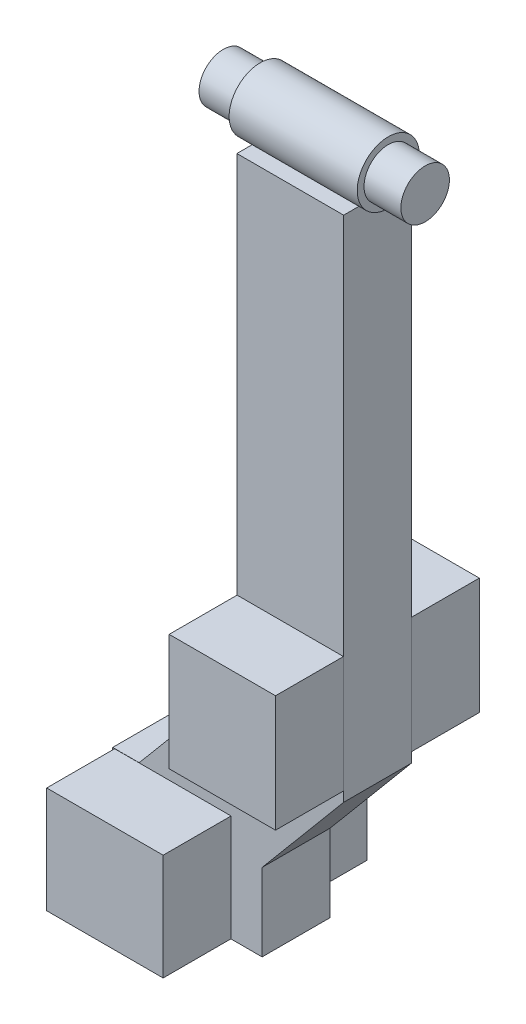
ISO-10303-21;
HEADER;
FILE_DESCRIPTION(('STEP AP214'),'2;1');
FILE_NAME('part.step','',(''),(''),'','','');
FILE_SCHEMA(('AUTOMOTIVE_DESIGN { 1 0 10303 214 1 1 1 1 }'));
ENDSEC;
DATA;
#1=APPLICATION_CONTEXT('core data for automotive mechanical design processes');
#2=APPLICATION_PROTOCOL_DEFINITION('international standard','automotive_design',2000,#1);
#3=PRODUCT_CONTEXT('',#1,'mechanical');
#4=PRODUCT('Part','Part','',(#3));
#5=PRODUCT_RELATED_PRODUCT_CATEGORY('part','',(#4));
#6=PRODUCT_DEFINITION_FORMATION('','',#4);
#7=PRODUCT_DEFINITION_CONTEXT('part definition',#1,'design');
#8=PRODUCT_DEFINITION('design','',#6,#7);
#9=PRODUCT_DEFINITION_SHAPE('','',#8);
#10=(LENGTH_UNIT() NAMED_UNIT(*) SI_UNIT(.MILLI.,.METRE.));
#11=(NAMED_UNIT(*) PLANE_ANGLE_UNIT() SI_UNIT($,.RADIAN.));
#12=(NAMED_UNIT(*) SI_UNIT($,.STERADIAN.) SOLID_ANGLE_UNIT());
#13=UNCERTAINTY_MEASURE_WITH_UNIT(LENGTH_MEASURE(1.E-05),#10,'distance_accuracy_value','');
#14=(GEOMETRIC_REPRESENTATION_CONTEXT(3) GLOBAL_UNCERTAINTY_ASSIGNED_CONTEXT((#13)) GLOBAL_UNIT_ASSIGNED_CONTEXT((#10,
#11,#12)) REPRESENTATION_CONTEXT('',''));
#15=CARTESIAN_POINT('',(0.,0.,0.));
#16=DIRECTION('',(0.,0.,1.));
#17=DIRECTION('',(1.,0.,0.));
#18=AXIS2_PLACEMENT_3D('',#15,#16,#17);
#19=CARTESIAN_POINT('',(33.,0.,0.));
#20=DIRECTION('',(1.,0.,0.));
#21=DIRECTION('',(0.,0.,-1.));
#22=AXIS2_PLACEMENT_3D('',#19,#20,#21);
#23=PLANE('',#22);
#24=CARTESIAN_POINT('',(33.,0.,0.));
#25=DIRECTION('',(1.,0.,0.));
#26=DIRECTION('',(0.,0.,-1.));
#27=AXIS2_PLACEMENT_3D('',#24,#25,#26);
#28=CIRCLE('',#27,16.);
#29=CARTESIAN_POINT('',(33.,0.,-16.));
#30=VERTEX_POINT('',#29);
#31=EDGE_CURVE('E400',#30,#30,#28,.T.);
#32=ORIENTED_EDGE('',*,*,#31,.T.);
#33=EDGE_LOOP('',(#32));
#34=FACE_BOUND('',#33,.T.);
#35=CARTESIAN_POINT('',(33.,0.,0.));
#36=DIRECTION('',(1.,0.,0.));
#37=DIRECTION('',(0.,0.,-1.));
#38=AXIS2_PLACEMENT_3D('',#35,#36,#37);
#39=CIRCLE('',#38,12.5);
#40=CARTESIAN_POINT('',(33.,0.,-12.5));
#41=VERTEX_POINT('',#40);
#42=EDGE_CURVE('E404',#41,#41,#39,.F.);
#43=ORIENTED_EDGE('',*,*,#42,.T.);
#44=EDGE_LOOP('',(#43));
#45=FACE_BOUND('',#44,.T.);
#46=ADVANCED_FACE('F16',(#34,#45),#23,.T.);
#47=CARTESIAN_POINT('',(-33.,0.,0.));
#48=DIRECTION('',(1.,0.,0.));
#49=DIRECTION('',(0.,0.,-1.));
#50=AXIS2_PLACEMENT_3D('',#47,#48,#49);
#51=PLANE('',#50);
#52=CARTESIAN_POINT('',(-33.,0.,0.));
#53=DIRECTION('',(1.,0.,0.));
#54=DIRECTION('',(0.,0.,-1.));
#55=AXIS2_PLACEMENT_3D('',#52,#53,#54);
#56=CIRCLE('',#55,16.);
#57=CARTESIAN_POINT('',(-33.,0.,-16.));
#58=VERTEX_POINT('',#57);
#59=EDGE_CURVE('E401',#58,#58,#56,.T.);
#60=ORIENTED_EDGE('',*,*,#59,.F.);
#61=EDGE_LOOP('',(#60));
#62=FACE_BOUND('',#61,.T.);
#63=CARTESIAN_POINT('',(-33.,0.,0.));
#64=DIRECTION('',(1.,0.,0.));
#65=DIRECTION('',(0.,0.,-1.));
#66=AXIS2_PLACEMENT_3D('',#63,#64,#65);
#67=CIRCLE('',#66,12.5);
#68=CARTESIAN_POINT('',(-33.,0.,-12.5));
#69=VERTEX_POINT('',#68);
#70=EDGE_CURVE('E11',#69,#69,#67,.F.);
#71=ORIENTED_EDGE('',*,*,#70,.F.);
#72=EDGE_LOOP('',(#71));
#73=FACE_BOUND('',#72,.T.);
#74=ADVANCED_FACE('F435',(#62,#73),#51,.F.);
#75=CARTESIAN_POINT('',(-27.5,-250.,17.5));
#76=DIRECTION('',(1.,0.,0.));
#77=DIRECTION('',(0.,1.,0.));
#78=AXIS2_PLACEMENT_3D('',#75,#76,#77);
#79=PLANE('',#78);
#80=CARTESIAN_POINT('',(-27.5,0.,0.));
#81=DIRECTION('',(1.,0.,0.));
#82=DIRECTION('',(0.,1.,0.));
#83=AXIS2_PLACEMENT_3D('',#80,#81,#82);
#84=CIRCLE('',#83,16.);
#85=CARTESIAN_POINT('',(-27.5,-13.,-9.32737905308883));
#86=VERTEX_POINT('',#85);
#87=CARTESIAN_POINT('',(-27.5,-13.,9.32737905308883));
#88=VERTEX_POINT('',#87);
#89=EDGE_CURVE('E206',#86,#88,#84,.F.);
#90=ORIENTED_EDGE('',*,*,#89,.F.);
#91=DIRECTION('',(0.,0.,-1.));
#92=VECTOR('',#91,1.);
#93=CARTESIAN_POINT('',(-27.5,-13.,17.5));
#94=LINE('',#93,#92);
#95=CARTESIAN_POINT('',(-27.5,-13.,-17.5));
#96=VERTEX_POINT('',#95);
#97=EDGE_CURVE('E194',#86,#96,#94,.T.);
#98=ORIENTED_EDGE('',*,*,#97,.T.);
#99=DIRECTION('',(0.,-1.,0.));
#100=VECTOR('',#99,1.);
#101=CARTESIAN_POINT('',(-27.5,-250.,-17.5));
#102=LINE('',#101,#100);
#103=CARTESIAN_POINT('',(-27.5,-250.,-17.5));
#104=VERTEX_POINT('',#103);
#105=EDGE_CURVE('E255',#96,#104,#102,.T.);
#106=ORIENTED_EDGE('',*,*,#105,.T.);
#107=DIRECTION('',(0.,0.,-1.));
#108=VECTOR('',#107,1.);
#109=CARTESIAN_POINT('',(-27.5,-250.,17.5));
#110=LINE('',#109,#108);
#111=CARTESIAN_POINT('',(-27.5,-250.,17.5));
#112=VERTEX_POINT('',#111);
#113=EDGE_CURVE('E202',#112,#104,#110,.T.);
#114=ORIENTED_EDGE('',*,*,#113,.F.);
#115=DIRECTION('',(0.,-1.,0.));
#116=VECTOR('',#115,1.);
#117=CARTESIAN_POINT('',(-27.5,-250.,17.5));
#118=LINE('',#117,#116);
#119=CARTESIAN_POINT('',(-27.5,-13.,17.5));
#120=VERTEX_POINT('',#119);
#121=EDGE_CURVE('E273',#120,#112,#118,.T.);
#122=ORIENTED_EDGE('',*,*,#121,.F.);
#123=EDGE_CURVE('E201',#120,#88,#94,.T.);
#124=ORIENTED_EDGE('',*,*,#123,.T.);
#125=EDGE_LOOP('',(#90,#98,#106,#114,#122,#124));
#126=FACE_BOUND('',#125,.T.);
#127=ADVANCED_FACE('F18',(#126),#79,.F.);
#128=CARTESIAN_POINT('',(27.5,-13.,17.5));
#129=DIRECTION('',(-1.,0.,0.));
#130=DIRECTION('',(0.,-1.,0.));
#131=AXIS2_PLACEMENT_3D('',#128,#129,#130);
#132=PLANE('',#131);
#133=CARTESIAN_POINT('',(27.5,0.,0.));
#134=DIRECTION('',(-1.,0.,0.));
#135=DIRECTION('',(0.,-1.,0.));
#136=AXIS2_PLACEMENT_3D('',#133,#134,#135);
#137=CIRCLE('',#136,16.);
#138=CARTESIAN_POINT('',(27.5,-13.,9.32737905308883));
#139=VERTEX_POINT('',#138);
#140=CARTESIAN_POINT('',(27.5,-13.,-9.32737905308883));
#141=VERTEX_POINT('',#140);
#142=EDGE_CURVE('E38',#139,#141,#137,.F.);
#143=ORIENTED_EDGE('',*,*,#142,.F.);
#144=DIRECTION('',(0.,0.,-1.));
#145=VECTOR('',#144,1.);
#146=CARTESIAN_POINT('',(27.5,-13.,17.5));
#147=LINE('',#146,#145);
#148=CARTESIAN_POINT('',(27.5,-13.,17.5));
#149=VERTEX_POINT('',#148);
#150=EDGE_CURVE('E235',#149,#139,#147,.T.);
#151=ORIENTED_EDGE('',*,*,#150,.F.);
#152=DIRECTION('',(0.,1.,0.));
#153=VECTOR('',#152,1.);
#154=CARTESIAN_POINT('',(27.5,-13.,17.5));
#155=LINE('',#154,#153);
#156=CARTESIAN_POINT('',(27.5,-275.,17.5));
#157=VERTEX_POINT('',#156);
#158=EDGE_CURVE('E258',#157,#149,#155,.T.);
#159=ORIENTED_EDGE('',*,*,#158,.F.);
#160=DIRECTION('',(0.,0.,-1.));
#161=VECTOR('',#160,1.);
#162=CARTESIAN_POINT('',(27.5,-275.,17.5));
#163=LINE('',#162,#161);
#164=CARTESIAN_POINT('',(27.5,-275.,-17.5));
#165=VERTEX_POINT('',#164);
#166=EDGE_CURVE('E232',#157,#165,#163,.T.);
#167=ORIENTED_EDGE('',*,*,#166,.T.);
#168=DIRECTION('',(0.,1.,0.));
#169=VECTOR('',#168,1.);
#170=CARTESIAN_POINT('',(27.5,-13.,-17.5));
#171=LINE('',#170,#169);
#172=CARTESIAN_POINT('',(27.5,-13.,-17.5));
#173=VERTEX_POINT('',#172);
#174=EDGE_CURVE('E240',#165,#173,#171,.T.);
#175=ORIENTED_EDGE('',*,*,#174,.T.);
#176=EDGE_CURVE('E237',#141,#173,#147,.T.);
#177=ORIENTED_EDGE('',*,*,#176,.F.);
#178=EDGE_LOOP('',(#143,#151,#159,#167,#175,#177));
#179=FACE_BOUND('',#178,.T.);
#180=ADVANCED_FACE('F540',(#179),#132,.F.);
#181=CARTESIAN_POINT('',(0.,-13.,17.5));
#182=DIRECTION('',(0.,-1.,0.));
#183=DIRECTION('',(1.,0.,0.));
#184=AXIS2_PLACEMENT_3D('',#181,#182,#183);
#185=PLANE('',#184);
#186=DIRECTION('',(-1.,0.,0.));
#187=VECTOR('',#186,1.);
#188=CARTESIAN_POINT('',(33.,-13.,9.32737905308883));
#189=LINE('',#188,#187);
#190=EDGE_CURVE('E24',#88,#139,#189,.F.);
#191=ORIENTED_EDGE('',*,*,#190,.F.);
#192=ORIENTED_EDGE('',*,*,#123,.F.);
#193=DIRECTION('',(-1.,0.,0.));
#194=VECTOR('',#193,1.);
#195=CARTESIAN_POINT('',(-27.5,-13.,17.5));
#196=LINE('',#195,#194);
#197=EDGE_CURVE('E239',#149,#120,#196,.T.);
#198=ORIENTED_EDGE('',*,*,#197,.F.);
#199=ORIENTED_EDGE('',*,*,#150,.T.);
#200=EDGE_LOOP('',(#191,#192,#198,#199));
#201=FACE_BOUND('',#200,.T.);
#202=ADVANCED_FACE('F537',(#201),#185,.F.);
#203=DIRECTION('',(-1.,0.,0.));
#204=VECTOR('',#203,1.);
#205=CARTESIAN_POINT('',(33.,-13.,-9.32737905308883));
#206=LINE('',#205,#204);
#207=EDGE_CURVE('E31',#141,#86,#206,.T.);
#208=ORIENTED_EDGE('',*,*,#207,.F.);
#209=ORIENTED_EDGE('',*,*,#176,.T.);
#210=DIRECTION('',(-1.,0.,0.));
#211=VECTOR('',#210,1.);
#212=CARTESIAN_POINT('',(0.,-13.,-17.5));
#213=LINE('',#212,#211);
#214=EDGE_CURVE('E198',#173,#96,#213,.T.);
#215=ORIENTED_EDGE('',*,*,#214,.T.);
#216=ORIENTED_EDGE('',*,*,#97,.F.);
#217=EDGE_LOOP('',(#208,#209,#215,#216));
#218=FACE_BOUND('',#217,.T.);
#219=ADVANCED_FACE('F196',(#218),#185,.F.);
#220=CARTESIAN_POINT('',(-27.5,-13.,-17.5));
#221=DIRECTION('',(0.,0.,1.));
#222=DIRECTION('',(1.,0.,0.));
#223=AXIS2_PLACEMENT_3D('',#220,#221,#222);
#224=PLANE('',#223);
#225=DIRECTION('',(0.,1.,0.));
#226=VECTOR('',#225,1.);
#227=CARTESIAN_POINT('',(-27.4,-270.,-17.5));
#228=LINE('',#227,#226);
#229=CARTESIAN_POINT('',(-27.4,-270.,-17.5));
#230=VERTEX_POINT('',#229);
#231=CARTESIAN_POINT('',(-27.4,-210.,-17.5));
#232=VERTEX_POINT('',#231);
#233=EDGE_CURVE('E357',#230,#232,#228,.T.);
#234=ORIENTED_EDGE('',*,*,#233,.F.);
#235=DIRECTION('',(-1.,0.,0.));
#236=VECTOR('',#235,1.);
#237=CARTESIAN_POINT('',(27.4,-270.,-17.5));
#238=LINE('',#237,#236);
#239=CARTESIAN_POINT('',(27.4,-270.,-17.5));
#240=VERTEX_POINT('',#239);
#241=EDGE_CURVE('E347',#240,#230,#238,.T.);
#242=ORIENTED_EDGE('',*,*,#241,.F.);
#243=DIRECTION('',(0.,-1.,0.));
#244=VECTOR('',#243,1.);
#245=CARTESIAN_POINT('',(27.4,-210.,-17.5));
#246=LINE('',#245,#244);
#247=CARTESIAN_POINT('',(27.4,-210.,-17.5));
#248=VERTEX_POINT('',#247);
#249=EDGE_CURVE('E351',#248,#240,#246,.T.);
#250=ORIENTED_EDGE('',*,*,#249,.F.);
#251=DIRECTION('',(1.,0.,0.));
#252=VECTOR('',#251,1.);
#253=CARTESIAN_POINT('',(-27.4,-210.,-17.5));
#254=LINE('',#253,#252);
#255=EDGE_CURVE('E354',#232,#248,#254,.T.);
#256=ORIENTED_EDGE('',*,*,#255,.F.);
#257=EDGE_LOOP('',(#234,#242,#250,#256));
#258=FACE_BOUND('',#257,.T.);
#259=ORIENTED_EDGE('',*,*,#105,.F.);
#260=ORIENTED_EDGE('',*,*,#214,.F.);
#261=ORIENTED_EDGE('',*,*,#174,.F.);
#262=DIRECTION('',(0.64278760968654,0.766044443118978,0.));
#263=VECTOR('',#262,1.);
#264=CARTESIAN_POINT('',(27.5,-275.,-17.5));
#265=LINE('',#264,#263);
#266=CARTESIAN_POINT('',(-14.5,-325.053650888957,-17.5));
#267=VERTEX_POINT('',#266);
#268=EDGE_CURVE('E243',#267,#165,#265,.T.);
#269=ORIENTED_EDGE('',*,*,#268,.F.);
#270=DIRECTION('',(0.,1.,0.));
#271=VECTOR('',#270,1.);
#272=CARTESIAN_POINT('',(-14.5,-325.053650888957,-17.5));
#273=LINE('',#272,#271);
#274=CARTESIAN_POINT('',(-14.5,-365.,-17.5));
#275=VERTEX_POINT('',#274);
#276=EDGE_CURVE('E245',#275,#267,#273,.T.);
#277=ORIENTED_EDGE('',*,*,#276,.F.);
#278=DIRECTION('',(1.,0.,0.));
#279=VECTOR('',#278,1.);
#280=CARTESIAN_POINT('',(-14.5,-365.,-17.5));
#281=LINE('',#280,#279);
#282=CARTESIAN_POINT('',(-91.5,-365.,-17.5));
#283=VERTEX_POINT('',#282);
#284=EDGE_CURVE('E247',#283,#275,#281,.T.);
#285=ORIENTED_EDGE('',*,*,#284,.F.);
#286=DIRECTION('',(0.,-1.,0.));
#287=VECTOR('',#286,1.);
#288=CARTESIAN_POINT('',(-91.5,-365.,-17.5));
#289=LINE('',#288,#287);
#290=CARTESIAN_POINT('',(-91.5,-310.,-17.5));
#291=VERTEX_POINT('',#290);
#292=EDGE_CURVE('E249',#291,#283,#289,.T.);
#293=ORIENTED_EDGE('',*,*,#292,.F.);
#294=DIRECTION('',(-1.,0.,0.));
#295=VECTOR('',#294,1.);
#296=CARTESIAN_POINT('',(-91.5,-310.,-17.5));
#297=LINE('',#296,#295);
#298=CARTESIAN_POINT('',(-77.8459778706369,-310.,-17.5));
#299=VERTEX_POINT('',#298);
#300=EDGE_CURVE('E251',#299,#291,#297,.T.);
#301=ORIENTED_EDGE('',*,*,#300,.F.);
#302=DIRECTION('',(-0.64278760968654,-0.766044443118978,0.));
#303=VECTOR('',#302,1.);
#304=CARTESIAN_POINT('',(-77.8459778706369,-310.,-17.5));
#305=LINE('',#304,#303);
#306=EDGE_CURVE('E253',#104,#299,#305,.T.);
#307=ORIENTED_EDGE('',*,*,#306,.F.);
#308=EDGE_LOOP('',(#259,#260,#261,#269,#277,#285,#293,#301,#307));
#309=FACE_BOUND('',#308,.T.);
#310=DIRECTION('',(0.,1.,0.));
#311=VECTOR('',#310,1.);
#312=CARTESIAN_POINT('',(-90.5,-364.9,-17.5));
#313=LINE('',#312,#311);
#314=CARTESIAN_POINT('',(-90.5,-364.9,-17.5));
#315=VERTEX_POINT('',#314);
#316=CARTESIAN_POINT('',(-90.5,-310.1,-17.5));
#317=VERTEX_POINT('',#316);
#318=EDGE_CURVE('E210',#315,#317,#313,.T.);
#319=ORIENTED_EDGE('',*,*,#318,.F.);
#320=DIRECTION('',(-1.,0.,0.));
#321=VECTOR('',#320,1.);
#322=CARTESIAN_POINT('',(-30.5,-364.9,-17.5));
#323=LINE('',#322,#321);
#324=CARTESIAN_POINT('',(-30.5,-364.9,-17.5));
#325=VERTEX_POINT('',#324);
#326=EDGE_CURVE('E380',#325,#315,#323,.T.);
#327=ORIENTED_EDGE('',*,*,#326,.F.);
#328=DIRECTION('',(0.,-1.,0.));
#329=VECTOR('',#328,1.);
#330=CARTESIAN_POINT('',(-30.5,-310.1,-17.5));
#331=LINE('',#330,#329);
#332=CARTESIAN_POINT('',(-30.5,-310.1,-17.5));
#333=VERTEX_POINT('',#332);
#334=EDGE_CURVE('E384',#333,#325,#331,.T.);
#335=ORIENTED_EDGE('',*,*,#334,.F.);
#336=DIRECTION('',(1.,0.,0.));
#337=VECTOR('',#336,1.);
#338=CARTESIAN_POINT('',(-90.5,-310.1,-17.5));
#339=LINE('',#338,#337);
#340=EDGE_CURVE('E387',#317,#333,#339,.T.);
#341=ORIENTED_EDGE('',*,*,#340,.F.);
#342=EDGE_LOOP('',(#319,#327,#335,#341));
#343=FACE_BOUND('',#342,.T.);
#344=ADVANCED_FACE('F532',(#258,#309,#343),#224,.F.);
#345=CARTESIAN_POINT('',(-27.5,-13.,17.5));
#346=DIRECTION('',(0.,0.,1.));
#347=DIRECTION('',(1.,0.,0.));
#348=AXIS2_PLACEMENT_3D('',#345,#346,#347);
#349=PLANE('',#348);
#350=DIRECTION('',(1.,0.,0.));
#351=VECTOR('',#350,1.);
#352=CARTESIAN_POINT('',(-90.5,-364.9,17.5));
#353=LINE('',#352,#351);
#354=CARTESIAN_POINT('',(-90.5,-364.9,17.5));
#355=VERTEX_POINT('',#354);
#356=CARTESIAN_POINT('',(-30.5,-364.9,17.5));
#357=VERTEX_POINT('',#356);
#358=EDGE_CURVE('E293',#355,#357,#353,.T.);
#359=ORIENTED_EDGE('',*,*,#358,.F.);
#360=DIRECTION('',(0.,-1.,0.));
#361=VECTOR('',#360,1.);
#362=CARTESIAN_POINT('',(-90.5,-310.1,17.5));
#363=LINE('',#362,#361);
#364=CARTESIAN_POINT('',(-90.5,-310.1,17.5));
#365=VERTEX_POINT('',#364);
#366=EDGE_CURVE('E295',#365,#355,#363,.T.);
#367=ORIENTED_EDGE('',*,*,#366,.F.);
#368=DIRECTION('',(-1.,0.,0.));
#369=VECTOR('',#368,1.);
#370=CARTESIAN_POINT('',(-90.5,-310.1,17.5));
#371=LINE('',#370,#369);
#372=CARTESIAN_POINT('',(-30.5,-310.1,17.5));
#373=VERTEX_POINT('',#372);
#374=EDGE_CURVE('E287',#373,#365,#371,.T.);
#375=ORIENTED_EDGE('',*,*,#374,.F.);
#376=DIRECTION('',(0.,1.,0.));
#377=VECTOR('',#376,1.);
#378=CARTESIAN_POINT('',(-30.5,-310.1,17.5));
#379=LINE('',#378,#377);
#380=EDGE_CURVE('E290',#357,#373,#379,.T.);
#381=ORIENTED_EDGE('',*,*,#380,.F.);
#382=EDGE_LOOP('',(#359,#367,#375,#381));
#383=FACE_BOUND('',#382,.T.);
#384=ORIENTED_EDGE('',*,*,#197,.T.);
#385=ORIENTED_EDGE('',*,*,#121,.T.);
#386=DIRECTION('',(-0.64278760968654,-0.766044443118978,0.));
#387=VECTOR('',#386,1.);
#388=CARTESIAN_POINT('',(-77.8459778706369,-310.,17.5));
#389=LINE('',#388,#387);
#390=CARTESIAN_POINT('',(-77.8459778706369,-310.,17.5));
#391=VERTEX_POINT('',#390);
#392=EDGE_CURVE('E271',#112,#391,#389,.T.);
#393=ORIENTED_EDGE('',*,*,#392,.T.);
#394=DIRECTION('',(-1.,0.,0.));
#395=VECTOR('',#394,1.);
#396=CARTESIAN_POINT('',(-91.5,-310.,17.5));
#397=LINE('',#396,#395);
#398=CARTESIAN_POINT('',(-91.5,-310.,17.5));
#399=VERTEX_POINT('',#398);
#400=EDGE_CURVE('E269',#391,#399,#397,.T.);
#401=ORIENTED_EDGE('',*,*,#400,.T.);
#402=DIRECTION('',(0.,-1.,0.));
#403=VECTOR('',#402,1.);
#404=CARTESIAN_POINT('',(-91.5,-365.,17.5));
#405=LINE('',#404,#403);
#406=CARTESIAN_POINT('',(-91.5,-365.,17.5));
#407=VERTEX_POINT('',#406);
#408=EDGE_CURVE('E267',#399,#407,#405,.T.);
#409=ORIENTED_EDGE('',*,*,#408,.T.);
#410=DIRECTION('',(1.,0.,0.));
#411=VECTOR('',#410,1.);
#412=CARTESIAN_POINT('',(-14.5,-365.,17.5));
#413=LINE('',#412,#411);
#414=CARTESIAN_POINT('',(-14.5,-365.,17.5));
#415=VERTEX_POINT('',#414);
#416=EDGE_CURVE('E265',#407,#415,#413,.T.);
#417=ORIENTED_EDGE('',*,*,#416,.T.);
#418=DIRECTION('',(0.,1.,0.));
#419=VECTOR('',#418,1.);
#420=CARTESIAN_POINT('',(-14.5,-325.053650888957,17.5));
#421=LINE('',#420,#419);
#422=CARTESIAN_POINT('',(-14.5,-325.053650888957,17.5));
#423=VERTEX_POINT('',#422);
#424=EDGE_CURVE('E263',#415,#423,#421,.T.);
#425=ORIENTED_EDGE('',*,*,#424,.T.);
#426=DIRECTION('',(0.64278760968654,0.766044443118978,0.));
#427=VECTOR('',#426,1.);
#428=CARTESIAN_POINT('',(27.5,-275.,17.5));
#429=LINE('',#428,#427);
#430=EDGE_CURVE('E261',#423,#157,#429,.T.);
#431=ORIENTED_EDGE('',*,*,#430,.T.);
#432=ORIENTED_EDGE('',*,*,#158,.T.);
#433=EDGE_LOOP('',(#384,#385,#393,#401,#409,#417,#425,#431,#432));
#434=FACE_BOUND('',#433,.T.);
#435=DIRECTION('',(1.,0.,0.));
#436=VECTOR('',#435,1.);
#437=CARTESIAN_POINT('',(-27.4,-270.,17.5));
#438=LINE('',#437,#436);
#439=CARTESIAN_POINT('',(-27.4,-270.,17.5));
#440=VERTEX_POINT('',#439);
#441=CARTESIAN_POINT('',(27.4,-270.,17.5));
#442=VERTEX_POINT('',#441);
#443=EDGE_CURVE('E322',#440,#442,#438,.T.);
#444=ORIENTED_EDGE('',*,*,#443,.F.);
#445=DIRECTION('',(0.,-1.,0.));
#446=VECTOR('',#445,1.);
#447=CARTESIAN_POINT('',(-27.4,-210.,17.5));
#448=LINE('',#447,#446);
#449=CARTESIAN_POINT('',(-27.4,-210.,17.5));
#450=VERTEX_POINT('',#449);
#451=EDGE_CURVE('E324',#450,#440,#448,.T.);
#452=ORIENTED_EDGE('',*,*,#451,.F.);
#453=DIRECTION('',(-1.,0.,0.));
#454=VECTOR('',#453,1.);
#455=CARTESIAN_POINT('',(-27.4,-210.,17.5));
#456=LINE('',#455,#454);
#457=CARTESIAN_POINT('',(27.4,-210.,17.5));
#458=VERTEX_POINT('',#457);
#459=EDGE_CURVE('E316',#458,#450,#456,.T.);
#460=ORIENTED_EDGE('',*,*,#459,.F.);
#461=DIRECTION('',(0.,1.,0.));
#462=VECTOR('',#461,1.);
#463=CARTESIAN_POINT('',(27.4,-210.,17.5));
#464=LINE('',#463,#462);
#465=EDGE_CURVE('E319',#442,#458,#464,.T.);
#466=ORIENTED_EDGE('',*,*,#465,.F.);
#467=EDGE_LOOP('',(#444,#452,#460,#466));
#468=FACE_BOUND('',#467,.T.);
#469=ADVANCED_FACE('F528',(#383,#434,#468),#349,.T.);
#470=CARTESIAN_POINT('',(-77.8459778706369,-310.,17.5));
#471=DIRECTION('',(0.766044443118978,-0.64278760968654,0.));
#472=DIRECTION('',(0.64278760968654,0.766044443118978,0.));
#473=AXIS2_PLACEMENT_3D('',#470,#471,#472);
#474=PLANE('',#473);
#475=ORIENTED_EDGE('',*,*,#306,.T.);
#476=DIRECTION('',(0.,0.,-1.));
#477=VECTOR('',#476,1.);
#478=CARTESIAN_POINT('',(-77.8459778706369,-310.,17.5));
#479=LINE('',#478,#477);
#480=EDGE_CURVE('E217',#391,#299,#479,.T.);
#481=ORIENTED_EDGE('',*,*,#480,.F.);
#482=ORIENTED_EDGE('',*,*,#392,.F.);
#483=ORIENTED_EDGE('',*,*,#113,.T.);
#484=EDGE_LOOP('',(#475,#481,#482,#483));
#485=FACE_BOUND('',#484,.T.);
#486=ADVANCED_FACE('F531',(#485),#474,.F.);
#487=CARTESIAN_POINT('',(-91.5,-310.,17.5));
#488=DIRECTION('',(0.,-1.,0.));
#489=DIRECTION('',(0.,0.,-1.));
#490=AXIS2_PLACEMENT_3D('',#487,#488,#489);
#491=PLANE('',#490);
#492=ORIENTED_EDGE('',*,*,#300,.T.);
#493=DIRECTION('',(0.,0.,-1.));
#494=VECTOR('',#493,1.);
#495=CARTESIAN_POINT('',(-91.5,-310.,17.5));
#496=LINE('',#495,#494);
#497=EDGE_CURVE('E220',#399,#291,#496,.T.);
#498=ORIENTED_EDGE('',*,*,#497,.F.);
#499=ORIENTED_EDGE('',*,*,#400,.F.);
#500=ORIENTED_EDGE('',*,*,#480,.T.);
#501=EDGE_LOOP('',(#492,#498,#499,#500));
#502=FACE_BOUND('',#501,.T.);
#503=ADVANCED_FACE('F558',(#502),#491,.F.);
#504=CARTESIAN_POINT('',(-91.5,-365.,17.5));
#505=DIRECTION('',(1.,0.,0.));
#506=DIRECTION('',(0.,1.,0.));
#507=AXIS2_PLACEMENT_3D('',#504,#505,#506);
#508=PLANE('',#507);
#509=ORIENTED_EDGE('',*,*,#292,.T.);
#510=DIRECTION('',(0.,0.,-1.));
#511=VECTOR('',#510,1.);
#512=CARTESIAN_POINT('',(-91.5,-365.,17.5));
#513=LINE('',#512,#511);
#514=EDGE_CURVE('E223',#407,#283,#513,.T.);
#515=ORIENTED_EDGE('',*,*,#514,.F.);
#516=ORIENTED_EDGE('',*,*,#408,.F.);
#517=ORIENTED_EDGE('',*,*,#497,.T.);
#518=EDGE_LOOP('',(#509,#515,#516,#517));
#519=FACE_BOUND('',#518,.T.);
#520=ADVANCED_FACE('F554',(#519),#508,.F.);
#521=CARTESIAN_POINT('',(-14.5,-365.,17.5));
#522=DIRECTION('',(0.,1.,0.));
#523=DIRECTION('',(0.,0.,1.));
#524=AXIS2_PLACEMENT_3D('',#521,#522,#523);
#525=PLANE('',#524);
#526=ORIENTED_EDGE('',*,*,#284,.T.);
#527=DIRECTION('',(0.,0.,-1.));
#528=VECTOR('',#527,1.);
#529=CARTESIAN_POINT('',(-14.5,-365.,17.5));
#530=LINE('',#529,#528);
#531=EDGE_CURVE('E226',#415,#275,#530,.T.);
#532=ORIENTED_EDGE('',*,*,#531,.F.);
#533=ORIENTED_EDGE('',*,*,#416,.F.);
#534=ORIENTED_EDGE('',*,*,#514,.T.);
#535=EDGE_LOOP('',(#526,#532,#533,#534));
#536=FACE_BOUND('',#535,.T.);
#537=ADVANCED_FACE('F550',(#536),#525,.F.);
#538=CARTESIAN_POINT('',(-14.5,-325.053650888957,17.5));
#539=DIRECTION('',(-1.,0.,0.));
#540=DIRECTION('',(0.,-1.,0.));
#541=AXIS2_PLACEMENT_3D('',#538,#539,#540);
#542=PLANE('',#541);
#543=ORIENTED_EDGE('',*,*,#276,.T.);
#544=DIRECTION('',(0.,0.,-1.));
#545=VECTOR('',#544,1.);
#546=CARTESIAN_POINT('',(-14.5,-325.053650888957,17.5));
#547=LINE('',#546,#545);
#548=EDGE_CURVE('E229',#423,#267,#547,.T.);
#549=ORIENTED_EDGE('',*,*,#548,.F.);
#550=ORIENTED_EDGE('',*,*,#424,.F.);
#551=ORIENTED_EDGE('',*,*,#531,.T.);
#552=EDGE_LOOP('',(#543,#549,#550,#551));
#553=FACE_BOUND('',#552,.T.);
#554=ADVANCED_FACE('F546',(#553),#542,.F.);
#555=CARTESIAN_POINT('',(27.5,-275.,17.5));
#556=DIRECTION('',(-0.766044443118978,0.64278760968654,0.));
#557=DIRECTION('',(-0.64278760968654,-0.766044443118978,0.));
#558=AXIS2_PLACEMENT_3D('',#555,#556,#557);
#559=PLANE('',#558);
#560=ORIENTED_EDGE('',*,*,#268,.T.);
#561=ORIENTED_EDGE('',*,*,#166,.F.);
#562=ORIENTED_EDGE('',*,*,#430,.F.);
#563=ORIENTED_EDGE('',*,*,#548,.T.);
#564=EDGE_LOOP('',(#560,#561,#562,#563));
#565=FACE_BOUND('',#564,.T.);
#566=ADVANCED_FACE('F526',(#565),#559,.F.);
#567=CARTESIAN_POINT('',(-90.5,-310.1,52.5));
#568=DIRECTION('',(1.,0.,0.));
#569=DIRECTION('',(0.,1.,0.));
#570=AXIS2_PLACEMENT_3D('',#567,#568,#569);
#571=PLANE('',#570);
#572=ORIENTED_EDGE('',*,*,#366,.T.);
#573=DIRECTION('',(0.,0.,-1.));
#574=VECTOR('',#573,1.);
#575=CARTESIAN_POINT('',(-90.5,-364.9,52.5));
#576=LINE('',#575,#574);
#577=CARTESIAN_POINT('',(-90.5,-364.9,52.5));
#578=VERTEX_POINT('',#577);
#579=EDGE_CURVE('E257',#578,#355,#576,.T.);
#580=ORIENTED_EDGE('',*,*,#579,.F.);
#581=DIRECTION('',(0.,-1.,0.));
#582=VECTOR('',#581,1.);
#583=CARTESIAN_POINT('',(-90.5,-310.1,52.5));
#584=LINE('',#583,#582);
#585=CARTESIAN_POINT('',(-90.5,-310.1,52.5));
#586=VERTEX_POINT('',#585);
#587=EDGE_CURVE('E289',#586,#578,#584,.T.);
#588=ORIENTED_EDGE('',*,*,#587,.F.);
#589=DIRECTION('',(0.,0.,-1.));
#590=VECTOR('',#589,1.);
#591=CARTESIAN_POINT('',(-90.5,-310.1,52.5));
#592=LINE('',#591,#590);
#593=EDGE_CURVE('E283',#586,#365,#592,.T.);
#594=ORIENTED_EDGE('',*,*,#593,.T.);
#595=EDGE_LOOP('',(#572,#580,#588,#594));
#596=FACE_BOUND('',#595,.T.);
#597=ADVANCED_FACE('F522',(#596),#571,.F.);
#598=CARTESIAN_POINT('',(-90.5,-364.9,52.5));
#599=DIRECTION('',(0.,1.,0.));
#600=DIRECTION('',(0.,0.,1.));
#601=AXIS2_PLACEMENT_3D('',#598,#599,#600);
#602=PLANE('',#601);
#603=ORIENTED_EDGE('',*,*,#358,.T.);
#604=DIRECTION('',(0.,0.,-1.));
#605=VECTOR('',#604,1.);
#606=CARTESIAN_POINT('',(-30.5,-364.9,52.5));
#607=LINE('',#606,#605);
#608=CARTESIAN_POINT('',(-30.5,-364.9,52.5));
#609=VERTEX_POINT('',#608);
#610=EDGE_CURVE('E278',#609,#357,#607,.T.);
#611=ORIENTED_EDGE('',*,*,#610,.F.);
#612=DIRECTION('',(1.,0.,0.));
#613=VECTOR('',#612,1.);
#614=CARTESIAN_POINT('',(-90.5,-364.9,52.5));
#615=LINE('',#614,#613);
#616=EDGE_CURVE('E302',#578,#609,#615,.T.);
#617=ORIENTED_EDGE('',*,*,#616,.F.);
#618=ORIENTED_EDGE('',*,*,#579,.T.);
#619=EDGE_LOOP('',(#603,#611,#617,#618));
#620=FACE_BOUND('',#619,.T.);
#621=ADVANCED_FACE('F518',(#620),#602,.F.);
#622=CARTESIAN_POINT('',(-30.5,-310.1,52.5));
#623=DIRECTION('',(-1.,0.,0.));
#624=DIRECTION('',(0.,-1.,0.));
#625=AXIS2_PLACEMENT_3D('',#622,#623,#624);
#626=PLANE('',#625);
#627=ORIENTED_EDGE('',*,*,#380,.T.);
#628=DIRECTION('',(0.,0.,-1.));
#629=VECTOR('',#628,1.);
#630=CARTESIAN_POINT('',(-30.5,-310.1,52.5));
#631=LINE('',#630,#629);
#632=CARTESIAN_POINT('',(-30.5,-310.1,52.5));
#633=VERTEX_POINT('',#632);
#634=EDGE_CURVE('E281',#633,#373,#631,.T.);
#635=ORIENTED_EDGE('',*,*,#634,.F.);
#636=DIRECTION('',(0.,1.,0.));
#637=VECTOR('',#636,1.);
#638=CARTESIAN_POINT('',(-30.5,-310.1,52.5));
#639=LINE('',#638,#637);
#640=EDGE_CURVE('E300',#609,#633,#639,.T.);
#641=ORIENTED_EDGE('',*,*,#640,.F.);
#642=ORIENTED_EDGE('',*,*,#610,.T.);
#643=EDGE_LOOP('',(#627,#635,#641,#642));
#644=FACE_BOUND('',#643,.T.);
#645=ADVANCED_FACE('F514',(#644),#626,.F.);
#646=CARTESIAN_POINT('',(-90.5,-310.1,52.5));
#647=DIRECTION('',(0.,-1.,0.));
#648=DIRECTION('',(0.,0.,-1.));
#649=AXIS2_PLACEMENT_3D('',#646,#647,#648);
#650=PLANE('',#649);
#651=ORIENTED_EDGE('',*,*,#374,.T.);
#652=ORIENTED_EDGE('',*,*,#593,.F.);
#653=DIRECTION('',(-1.,0.,0.));
#654=VECTOR('',#653,1.);
#655=CARTESIAN_POINT('',(-90.5,-310.1,52.5));
#656=LINE('',#655,#654);
#657=EDGE_CURVE('E286',#633,#586,#656,.T.);
#658=ORIENTED_EDGE('',*,*,#657,.F.);
#659=ORIENTED_EDGE('',*,*,#634,.T.);
#660=EDGE_LOOP('',(#651,#652,#658,#659));
#661=FACE_BOUND('',#660,.T.);
#662=ADVANCED_FACE('F510',(#661),#650,.F.);
#663=CARTESIAN_POINT('',(-90.5,-364.9,52.5));
#664=DIRECTION('',(0.,0.,1.));
#665=DIRECTION('',(1.,0.,0.));
#666=AXIS2_PLACEMENT_3D('',#663,#664,#665);
#667=PLANE('',#666);
#668=ORIENTED_EDGE('',*,*,#587,.T.);
#669=ORIENTED_EDGE('',*,*,#616,.T.);
#670=ORIENTED_EDGE('',*,*,#640,.T.);
#671=ORIENTED_EDGE('',*,*,#657,.T.);
#672=EDGE_LOOP('',(#668,#669,#670,#671));
#673=FACE_BOUND('',#672,.T.);
#674=ADVANCED_FACE('F506',(#673),#667,.T.);
#675=CARTESIAN_POINT('',(-27.4,-210.,52.5));
#676=DIRECTION('',(1.,0.,0.));
#677=DIRECTION('',(0.,1.,0.));
#678=AXIS2_PLACEMENT_3D('',#675,#676,#677);
#679=PLANE('',#678);
#680=ORIENTED_EDGE('',*,*,#451,.T.);
#681=DIRECTION('',(0.,0.,-1.));
#682=VECTOR('',#681,1.);
#683=CARTESIAN_POINT('',(-27.4,-270.,52.5));
#684=LINE('',#683,#682);
#685=CARTESIAN_POINT('',(-27.4,-270.,52.5));
#686=VERTEX_POINT('',#685);
#687=EDGE_CURVE('E298',#686,#440,#684,.T.);
#688=ORIENTED_EDGE('',*,*,#687,.F.);
#689=DIRECTION('',(0.,-1.,0.));
#690=VECTOR('',#689,1.);
#691=CARTESIAN_POINT('',(-27.4,-210.,52.5));
#692=LINE('',#691,#690);
#693=CARTESIAN_POINT('',(-27.4,-210.,52.5));
#694=VERTEX_POINT('',#693);
#695=EDGE_CURVE('E318',#694,#686,#692,.T.);
#696=ORIENTED_EDGE('',*,*,#695,.F.);
#697=DIRECTION('',(0.,0.,-1.));
#698=VECTOR('',#697,1.);
#699=CARTESIAN_POINT('',(-27.4,-210.,52.5));
#700=LINE('',#699,#698);
#701=EDGE_CURVE('E312',#694,#450,#700,.T.);
#702=ORIENTED_EDGE('',*,*,#701,.T.);
#703=EDGE_LOOP('',(#680,#688,#696,#702));
#704=FACE_BOUND('',#703,.T.);
#705=ADVANCED_FACE('F502',(#704),#679,.F.);
#706=CARTESIAN_POINT('',(-27.4,-270.,52.5));
#707=DIRECTION('',(0.,1.,0.));
#708=DIRECTION('',(0.,0.,1.));
#709=AXIS2_PLACEMENT_3D('',#706,#707,#708);
#710=PLANE('',#709);
#711=ORIENTED_EDGE('',*,*,#443,.T.);
#712=DIRECTION('',(0.,0.,-1.));
#713=VECTOR('',#712,1.);
#714=CARTESIAN_POINT('',(27.4,-270.,52.5));
#715=LINE('',#714,#713);
#716=CARTESIAN_POINT('',(27.4,-270.,52.5));
#717=VERTEX_POINT('',#716);
#718=EDGE_CURVE('E307',#717,#442,#715,.T.);
#719=ORIENTED_EDGE('',*,*,#718,.F.);
#720=DIRECTION('',(1.,0.,0.));
#721=VECTOR('',#720,1.);
#722=CARTESIAN_POINT('',(-27.4,-270.,52.5));
#723=LINE('',#722,#721);
#724=EDGE_CURVE('E331',#686,#717,#723,.T.);
#725=ORIENTED_EDGE('',*,*,#724,.F.);
#726=ORIENTED_EDGE('',*,*,#687,.T.);
#727=EDGE_LOOP('',(#711,#719,#725,#726));
#728=FACE_BOUND('',#727,.T.);
#729=ADVANCED_FACE('F498',(#728),#710,.F.);
#730=CARTESIAN_POINT('',(27.4,-210.,52.5));
#731=DIRECTION('',(-1.,0.,0.));
#732=DIRECTION('',(0.,-1.,0.));
#733=AXIS2_PLACEMENT_3D('',#730,#731,#732);
#734=PLANE('',#733);
#735=ORIENTED_EDGE('',*,*,#465,.T.);
#736=DIRECTION('',(0.,0.,-1.));
#737=VECTOR('',#736,1.);
#738=CARTESIAN_POINT('',(27.4,-210.,52.5));
#739=LINE('',#738,#737);
#740=CARTESIAN_POINT('',(27.4,-210.,52.5));
#741=VERTEX_POINT('',#740);
#742=EDGE_CURVE('E310',#741,#458,#739,.T.);
#743=ORIENTED_EDGE('',*,*,#742,.F.);
#744=DIRECTION('',(0.,1.,0.));
#745=VECTOR('',#744,1.);
#746=CARTESIAN_POINT('',(27.4,-210.,52.5));
#747=LINE('',#746,#745);
#748=EDGE_CURVE('E329',#717,#741,#747,.T.);
#749=ORIENTED_EDGE('',*,*,#748,.F.);
#750=ORIENTED_EDGE('',*,*,#718,.T.);
#751=EDGE_LOOP('',(#735,#743,#749,#750));
#752=FACE_BOUND('',#751,.T.);
#753=ADVANCED_FACE('F494',(#752),#734,.F.);
#754=CARTESIAN_POINT('',(-27.4,-210.,52.5));
#755=DIRECTION('',(0.,-1.,0.));
#756=DIRECTION('',(0.,0.,-1.));
#757=AXIS2_PLACEMENT_3D('',#754,#755,#756);
#758=PLANE('',#757);
#759=ORIENTED_EDGE('',*,*,#459,.T.);
#760=ORIENTED_EDGE('',*,*,#701,.F.);
#761=DIRECTION('',(-1.,0.,0.));
#762=VECTOR('',#761,1.);
#763=CARTESIAN_POINT('',(-27.4,-210.,52.5));
#764=LINE('',#763,#762);
#765=EDGE_CURVE('E315',#741,#694,#764,.T.);
#766=ORIENTED_EDGE('',*,*,#765,.F.);
#767=ORIENTED_EDGE('',*,*,#742,.T.);
#768=EDGE_LOOP('',(#759,#760,#766,#767));
#769=FACE_BOUND('',#768,.T.);
#770=ADVANCED_FACE('F490',(#769),#758,.F.);
#771=CARTESIAN_POINT('',(-27.4,-270.,52.5));
#772=DIRECTION('',(0.,0.,1.));
#773=DIRECTION('',(1.,0.,0.));
#774=AXIS2_PLACEMENT_3D('',#771,#772,#773);
#775=PLANE('',#774);
#776=ORIENTED_EDGE('',*,*,#695,.T.);
#777=ORIENTED_EDGE('',*,*,#724,.T.);
#778=ORIENTED_EDGE('',*,*,#748,.T.);
#779=ORIENTED_EDGE('',*,*,#765,.T.);
#780=EDGE_LOOP('',(#776,#777,#778,#779));
#781=FACE_BOUND('',#780,.T.);
#782=ADVANCED_FACE('F486',(#781),#775,.T.);
#783=CARTESIAN_POINT('',(-27.4,-270.,-52.5));
#784=DIRECTION('',(1.,0.,0.));
#785=DIRECTION('',(0.,1.,0.));
#786=AXIS2_PLACEMENT_3D('',#783,#784,#785);
#787=PLANE('',#786);
#788=ORIENTED_EDGE('',*,*,#233,.T.);
#789=DIRECTION('',(0.,0.,1.));
#790=VECTOR('',#789,1.);
#791=CARTESIAN_POINT('',(-27.4,-210.,-52.5));
#792=LINE('',#791,#790);
#793=CARTESIAN_POINT('',(-27.4,-210.,-52.5));
#794=VERTEX_POINT('',#793);
#795=EDGE_CURVE('E327',#794,#232,#792,.T.);
#796=ORIENTED_EDGE('',*,*,#795,.F.);
#797=DIRECTION('',(0.,1.,0.));
#798=VECTOR('',#797,1.);
#799=CARTESIAN_POINT('',(-27.4,-270.,-52.5));
#800=LINE('',#799,#798);
#801=CARTESIAN_POINT('',(-27.4,-270.,-52.5));
#802=VERTEX_POINT('',#801);
#803=EDGE_CURVE('E350',#802,#794,#800,.T.);
#804=ORIENTED_EDGE('',*,*,#803,.F.);
#805=DIRECTION('',(0.,0.,1.));
#806=VECTOR('',#805,1.);
#807=CARTESIAN_POINT('',(-27.4,-270.,-52.5));
#808=LINE('',#807,#806);
#809=EDGE_CURVE('E343',#802,#230,#808,.T.);
#810=ORIENTED_EDGE('',*,*,#809,.T.);
#811=EDGE_LOOP('',(#788,#796,#804,#810));
#812=FACE_BOUND('',#811,.T.);
#813=ADVANCED_FACE('F482',(#812),#787,.F.);
#814=CARTESIAN_POINT('',(-27.4,-210.,-52.5));
#815=DIRECTION('',(0.,-1.,0.));
#816=DIRECTION('',(0.,0.,-1.));
#817=AXIS2_PLACEMENT_3D('',#814,#815,#816);
#818=PLANE('',#817);
#819=ORIENTED_EDGE('',*,*,#255,.T.);
#820=DIRECTION('',(0.,0.,1.));
#821=VECTOR('',#820,1.);
#822=CARTESIAN_POINT('',(27.4,-210.,-52.5));
#823=LINE('',#822,#821);
#824=CARTESIAN_POINT('',(27.4,-210.,-52.5));
#825=VERTEX_POINT('',#824);
#826=EDGE_CURVE('E337',#825,#248,#823,.T.);
#827=ORIENTED_EDGE('',*,*,#826,.F.);
#828=DIRECTION('',(1.,0.,0.));
#829=VECTOR('',#828,1.);
#830=CARTESIAN_POINT('',(-27.4,-210.,-52.5));
#831=LINE('',#830,#829);
#832=EDGE_CURVE('E364',#794,#825,#831,.T.);
#833=ORIENTED_EDGE('',*,*,#832,.F.);
#834=ORIENTED_EDGE('',*,*,#795,.T.);
#835=EDGE_LOOP('',(#819,#827,#833,#834));
#836=FACE_BOUND('',#835,.T.);
#837=ADVANCED_FACE('F478',(#836),#818,.F.);
#838=CARTESIAN_POINT('',(27.4,-210.,-52.5));
#839=DIRECTION('',(-1.,0.,0.));
#840=DIRECTION('',(0.,-1.,0.));
#841=AXIS2_PLACEMENT_3D('',#838,#839,#840);
#842=PLANE('',#841);
#843=ORIENTED_EDGE('',*,*,#249,.T.);
#844=DIRECTION('',(0.,0.,1.));
#845=VECTOR('',#844,1.);
#846=CARTESIAN_POINT('',(27.4,-270.,-52.5));
#847=LINE('',#846,#845);
#848=CARTESIAN_POINT('',(27.4,-270.,-52.5));
#849=VERTEX_POINT('',#848);
#850=EDGE_CURVE('E340',#849,#240,#847,.T.);
#851=ORIENTED_EDGE('',*,*,#850,.F.);
#852=DIRECTION('',(0.,-1.,0.));
#853=VECTOR('',#852,1.);
#854=CARTESIAN_POINT('',(27.4,-210.,-52.5));
#855=LINE('',#854,#853);
#856=EDGE_CURVE('E362',#825,#849,#855,.T.);
#857=ORIENTED_EDGE('',*,*,#856,.F.);
#858=ORIENTED_EDGE('',*,*,#826,.T.);
#859=EDGE_LOOP('',(#843,#851,#857,#858));
#860=FACE_BOUND('',#859,.T.);
#861=ADVANCED_FACE('F474',(#860),#842,.F.);
#862=CARTESIAN_POINT('',(27.4,-270.,-52.5));
#863=DIRECTION('',(0.,1.,0.));
#864=DIRECTION('',(0.,0.,1.));
#865=AXIS2_PLACEMENT_3D('',#862,#863,#864);
#866=PLANE('',#865);
#867=ORIENTED_EDGE('',*,*,#241,.T.);
#868=ORIENTED_EDGE('',*,*,#809,.F.);
#869=DIRECTION('',(-1.,0.,0.));
#870=VECTOR('',#869,1.);
#871=CARTESIAN_POINT('',(27.4,-270.,-52.5));
#872=LINE('',#871,#870);
#873=EDGE_CURVE('E346',#849,#802,#872,.T.);
#874=ORIENTED_EDGE('',*,*,#873,.F.);
#875=ORIENTED_EDGE('',*,*,#850,.T.);
#876=EDGE_LOOP('',(#867,#868,#874,#875));
#877=FACE_BOUND('',#876,.T.);
#878=ADVANCED_FACE('F470',(#877),#866,.F.);
#879=CARTESIAN_POINT('',(-27.4,-210.,-52.5));
#880=DIRECTION('',(0.,0.,-1.));
#881=DIRECTION('',(-1.,0.,0.));
#882=AXIS2_PLACEMENT_3D('',#879,#880,#881);
#883=PLANE('',#882);
#884=ORIENTED_EDGE('',*,*,#803,.T.);
#885=ORIENTED_EDGE('',*,*,#832,.T.);
#886=ORIENTED_EDGE('',*,*,#856,.T.);
#887=ORIENTED_EDGE('',*,*,#873,.T.);
#888=EDGE_LOOP('',(#884,#885,#886,#887));
#889=FACE_BOUND('',#888,.T.);
#890=ADVANCED_FACE('F466',(#889),#883,.T.);
#891=CARTESIAN_POINT('',(-90.5,-364.9,-52.5));
#892=DIRECTION('',(1.,0.,0.));
#893=DIRECTION('',(0.,1.,0.));
#894=AXIS2_PLACEMENT_3D('',#891,#892,#893);
#895=PLANE('',#894);
#896=ORIENTED_EDGE('',*,*,#318,.T.);
#897=DIRECTION('',(0.,0.,1.));
#898=VECTOR('',#897,1.);
#899=CARTESIAN_POINT('',(-90.5,-310.1,-52.5));
#900=LINE('',#899,#898);
#901=CARTESIAN_POINT('',(-90.5,-310.1,-52.5));
#902=VERTEX_POINT('',#901);
#903=EDGE_CURVE('E360',#902,#317,#900,.T.);
#904=ORIENTED_EDGE('',*,*,#903,.F.);
#905=DIRECTION('',(0.,1.,0.));
#906=VECTOR('',#905,1.);
#907=CARTESIAN_POINT('',(-90.5,-364.9,-52.5));
#908=LINE('',#907,#906);
#909=CARTESIAN_POINT('',(-90.5,-364.9,-52.5));
#910=VERTEX_POINT('',#909);
#911=EDGE_CURVE('E383',#910,#902,#908,.T.);
#912=ORIENTED_EDGE('',*,*,#911,.F.);
#913=DIRECTION('',(0.,0.,1.));
#914=VECTOR('',#913,1.);
#915=CARTESIAN_POINT('',(-90.5,-364.9,-52.5));
#916=LINE('',#915,#914);
#917=EDGE_CURVE('E376',#910,#315,#916,.T.);
#918=ORIENTED_EDGE('',*,*,#917,.T.);
#919=EDGE_LOOP('',(#896,#904,#912,#918));
#920=FACE_BOUND('',#919,.T.);
#921=ADVANCED_FACE('F462',(#920),#895,.F.);
#922=CARTESIAN_POINT('',(-90.5,-310.1,-52.5));
#923=DIRECTION('',(0.,-1.,0.));
#924=DIRECTION('',(0.,0.,-1.));
#925=AXIS2_PLACEMENT_3D('',#922,#923,#924);
#926=PLANE('',#925);
#927=ORIENTED_EDGE('',*,*,#340,.T.);
#928=DIRECTION('',(0.,0.,1.));
#929=VECTOR('',#928,1.);
#930=CARTESIAN_POINT('',(-30.5,-310.1,-52.5));
#931=LINE('',#930,#929);
#932=CARTESIAN_POINT('',(-30.5,-310.1,-52.5));
#933=VERTEX_POINT('',#932);
#934=EDGE_CURVE('E370',#933,#333,#931,.T.);
#935=ORIENTED_EDGE('',*,*,#934,.F.);
#936=DIRECTION('',(1.,0.,0.));
#937=VECTOR('',#936,1.);
#938=CARTESIAN_POINT('',(-90.5,-310.1,-52.5));
#939=LINE('',#938,#937);
#940=EDGE_CURVE('E395',#902,#933,#939,.T.);
#941=ORIENTED_EDGE('',*,*,#940,.F.);
#942=ORIENTED_EDGE('',*,*,#903,.T.);
#943=EDGE_LOOP('',(#927,#935,#941,#942));
#944=FACE_BOUND('',#943,.T.);
#945=ADVANCED_FACE('F458',(#944),#926,.F.);
#946=CARTESIAN_POINT('',(-30.5,-310.1,-52.5));
#947=DIRECTION('',(-1.,0.,0.));
#948=DIRECTION('',(0.,-1.,0.));
#949=AXIS2_PLACEMENT_3D('',#946,#947,#948);
#950=PLANE('',#949);
#951=ORIENTED_EDGE('',*,*,#334,.T.);
#952=DIRECTION('',(0.,0.,1.));
#953=VECTOR('',#952,1.);
#954=CARTESIAN_POINT('',(-30.5,-364.9,-52.5));
#955=LINE('',#954,#953);
#956=CARTESIAN_POINT('',(-30.5,-364.9,-52.5));
#957=VERTEX_POINT('',#956);
#958=EDGE_CURVE('E373',#957,#325,#955,.T.);
#959=ORIENTED_EDGE('',*,*,#958,.F.);
#960=DIRECTION('',(0.,-1.,0.));
#961=VECTOR('',#960,1.);
#962=CARTESIAN_POINT('',(-30.5,-310.1,-52.5));
#963=LINE('',#962,#961);
#964=EDGE_CURVE('E393',#933,#957,#963,.T.);
#965=ORIENTED_EDGE('',*,*,#964,.F.);
#966=ORIENTED_EDGE('',*,*,#934,.T.);
#967=EDGE_LOOP('',(#951,#959,#965,#966));
#968=FACE_BOUND('',#967,.T.);
#969=ADVANCED_FACE('F454',(#968),#950,.F.);
#970=CARTESIAN_POINT('',(-30.5,-364.9,-52.5));
#971=DIRECTION('',(0.,1.,0.));
#972=DIRECTION('',(0.,0.,1.));
#973=AXIS2_PLACEMENT_3D('',#970,#971,#972);
#974=PLANE('',#973);
#975=ORIENTED_EDGE('',*,*,#326,.T.);
#976=ORIENTED_EDGE('',*,*,#917,.F.);
#977=DIRECTION('',(-1.,0.,0.));
#978=VECTOR('',#977,1.);
#979=CARTESIAN_POINT('',(-30.5,-364.9,-52.5));
#980=LINE('',#979,#978);
#981=EDGE_CURVE('E379',#957,#910,#980,.T.);
#982=ORIENTED_EDGE('',*,*,#981,.F.);
#983=ORIENTED_EDGE('',*,*,#958,.T.);
#984=EDGE_LOOP('',(#975,#976,#982,#983));
#985=FACE_BOUND('',#984,.T.);
#986=ADVANCED_FACE('F450',(#985),#974,.F.);
#987=CARTESIAN_POINT('',(-90.5,-364.9,-52.5));
#988=DIRECTION('',(0.,0.,1.));
#989=DIRECTION('',(1.,0.,0.));
#990=AXIS2_PLACEMENT_3D('',#987,#988,#989);
#991=PLANE('',#990);
#992=ORIENTED_EDGE('',*,*,#911,.T.);
#993=ORIENTED_EDGE('',*,*,#940,.T.);
#994=ORIENTED_EDGE('',*,*,#964,.T.);
#995=ORIENTED_EDGE('',*,*,#981,.T.);
#996=EDGE_LOOP('',(#992,#993,#994,#995));
#997=FACE_BOUND('',#996,.T.);
#998=ADVANCED_FACE('F446',(#997),#991,.F.);
#999=CARTESIAN_POINT('',(33.,0.,0.));
#1000=DIRECTION('',(-1.,0.,0.));
#1001=DIRECTION('',(0.,0.,1.));
#1002=AXIS2_PLACEMENT_3D('',#999,#1000,#1001);
#1003=CYLINDRICAL_SURFACE('',#1002,16.);
#1004=ORIENTED_EDGE('',*,*,#59,.T.);
#1005=EDGE_LOOP('',(#1004));
#1006=FACE_BOUND('',#1005,.T.);
#1007=ORIENTED_EDGE('',*,*,#31,.F.);
#1008=EDGE_LOOP('',(#1007));
#1009=FACE_BOUND('',#1008,.T.);
#1010=ORIENTED_EDGE('',*,*,#89,.T.);
#1011=ORIENTED_EDGE('',*,*,#190,.T.);
#1012=ORIENTED_EDGE('',*,*,#142,.T.);
#1013=ORIENTED_EDGE('',*,*,#207,.T.);
#1014=EDGE_LOOP('',(#1010,#1011,#1012,#1013));
#1015=FACE_BOUND('',#1014,.T.);
#1016=ADVANCED_FACE('F212',(#1006,#1009,#1015),#1003,.T.);
#1017=CARTESIAN_POINT('',(-52.,0.,0.));
#1018=DIRECTION('',(1.,0.,0.));
#1019=DIRECTION('',(0.,0.,-1.));
#1020=AXIS2_PLACEMENT_3D('',#1017,#1018,#1019);
#1021=PLANE('',#1020);
#1022=CARTESIAN_POINT('',(-52.,0.,0.));
#1023=DIRECTION('',(1.,0.,0.));
#1024=DIRECTION('',(0.,0.,-1.));
#1025=AXIS2_PLACEMENT_3D('',#1022,#1023,#1024);
#1026=CIRCLE('',#1025,12.5);
#1027=CARTESIAN_POINT('',(-52.,0.,-12.5));
#1028=VERTEX_POINT('',#1027);
#1029=EDGE_CURVE('E410',#1028,#1028,#1026,.T.);
#1030=ORIENTED_EDGE('',*,*,#1029,.F.);
#1031=EDGE_LOOP('',(#1030));
#1032=FACE_BOUND('',#1031,.T.);
#1033=ADVANCED_FACE('F429',(#1032),#1021,.F.);
#1034=CARTESIAN_POINT('',(52.,0.,0.));
#1035=DIRECTION('',(-1.,0.,0.));
#1036=DIRECTION('',(0.,0.,1.));
#1037=AXIS2_PLACEMENT_3D('',#1034,#1035,#1036);
#1038=CYLINDRICAL_SURFACE('',#1037,12.5);
#1039=ORIENTED_EDGE('',*,*,#1029,.T.);
#1040=EDGE_LOOP('',(#1039));
#1041=FACE_BOUND('',#1040,.T.);
#1042=ORIENTED_EDGE('',*,*,#70,.T.);
#1043=EDGE_LOOP('',(#1042));
#1044=FACE_BOUND('',#1043,.T.);
#1045=ADVANCED_FACE('F420',(#1041,#1044),#1038,.T.);
#1046=ORIENTED_EDGE('',*,*,#42,.F.);
#1047=EDGE_LOOP('',(#1046));
#1048=FACE_BOUND('',#1047,.T.);
#1049=CARTESIAN_POINT('',(52.,0.,0.));
#1050=DIRECTION('',(1.,0.,0.));
#1051=DIRECTION('',(0.,0.,-1.));
#1052=AXIS2_PLACEMENT_3D('',#1049,#1050,#1051);
#1053=CIRCLE('',#1052,12.5);
#1054=CARTESIAN_POINT('',(52.,0.,-12.5));
#1055=VERTEX_POINT('',#1054);
#1056=EDGE_CURVE('E409',#1055,#1055,#1053,.T.);
#1057=ORIENTED_EDGE('',*,*,#1056,.F.);
#1058=EDGE_LOOP('',(#1057));
#1059=FACE_BOUND('',#1058,.T.);
#1060=ADVANCED_FACE('F418',(#1048,#1059),#1038,.T.);
#1061=CARTESIAN_POINT('',(52.,0.,0.));
#1062=DIRECTION('',(1.,0.,0.));
#1063=DIRECTION('',(0.,0.,-1.));
#1064=AXIS2_PLACEMENT_3D('',#1061,#1062,#1063);
#1065=PLANE('',#1064);
#1066=ORIENTED_EDGE('',*,*,#1056,.T.);
#1067=EDGE_LOOP('',(#1066));
#1068=FACE_BOUND('',#1067,.T.);
#1069=ADVANCED_FACE('F416',(#1068),#1065,.T.);
#1070=CLOSED_SHELL('',(#46,#74,#127,#180,#202,#219,#344,#469,#486,#503,#520,#537,#554,#566,#597,
#621,#645,#662,#674,#705,#729,#753,#770,#782,#813,#837,#861,#878,#890,#921,#945,#969,#986,#998,
#1016,#1033,#1045,#1060,#1069));
#1071=MANIFOLD_SOLID_BREP('B1',#1070);
#1072=ADVANCED_BREP_SHAPE_REPRESENTATION('',(#18,#1071),#14);
#1073=SHAPE_DEFINITION_REPRESENTATION(#9,#1072);
ENDSEC;
END-ISO-10303-21;
